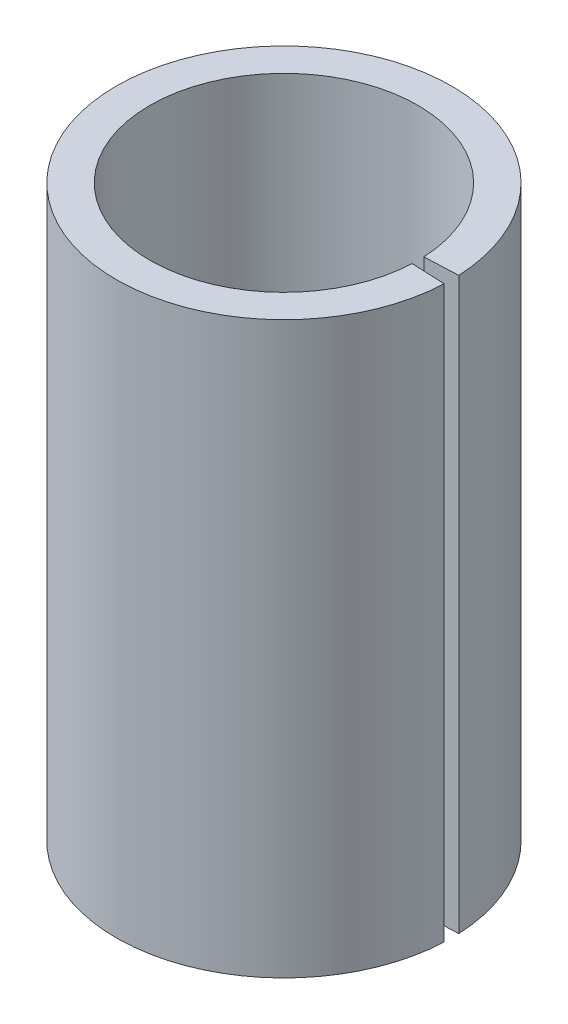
from build123d import *

# Parameters (mm, degrees)
EXTRUDE1_DEPTH = 8.636


with BuildPart() as part:
    # Sketch1 → Extrude1 (new body)
    with BuildSketch(Plane(origin=(0, 0, 0), x_dir=(1, 0, 0), z_dir=(0, 1, 0))):
        with BuildLine():
            Line((2.537582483, -0.110793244), (2.030065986, -0.088634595))
            ThreePointArc((2.030065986, -0.088634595), (-2.032, 0), (2.030065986, 0.088634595))
            Line((2.030065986, 0.088634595), (2.537582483, 0.110793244))
            ThreePointArc((2.537582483, 0.110793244), (-2.54, 0), (2.537582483, -0.110793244))
        make_face()
    extrude(amount=EXTRUDE1_DEPTH)


solid = part.part
